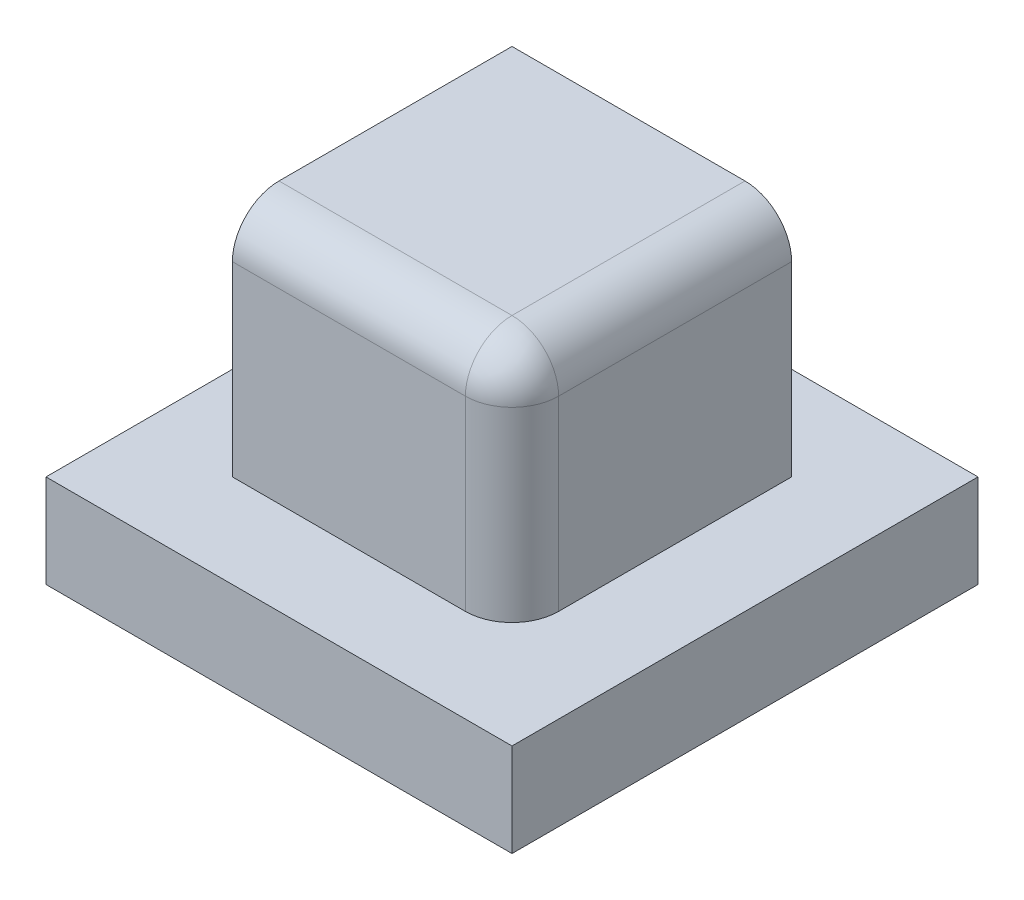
from build123d import *

# Parameters (mm, degrees)
SKETCH1_W      = 100
SKETCH1_H      = 20
EXTRUDE1_DEPTH = 50
SKETCH2_W      = 60
SKETCH2_H      = 60
EXTRUDE2_DEPTH = 50
FILLET1_R      = 10


with BuildPart() as part:
    # Sketch1 → Extrude1 (new, symmetric)
    with BuildSketch(Plane.XY):
        with Locations((0, 10)):
            Rectangle(SKETCH1_W, SKETCH1_H)
    extrude(amount=EXTRUDE1_DEPTH, both=True)

    # Sketch2 → Extrude2 (add)
    with BuildSketch(Plane(origin=(0, 20, 0), x_dir=(-1, 0, 0), z_dir=(0, 1, 0))):
        Rectangle(SKETCH2_W, SKETCH2_H)
    extrude(amount=EXTRUDE2_DEPTH)

    # Fillet1
    fillet1_edges = [part.edges().sort_by_distance(p)[0] for p in [
        (30, 45, 30),
        (30, 70, 0),
        (0, 70, 30),
    ]]
    fillet(fillet1_edges, radius=FILLET1_R)


solid = part.part
